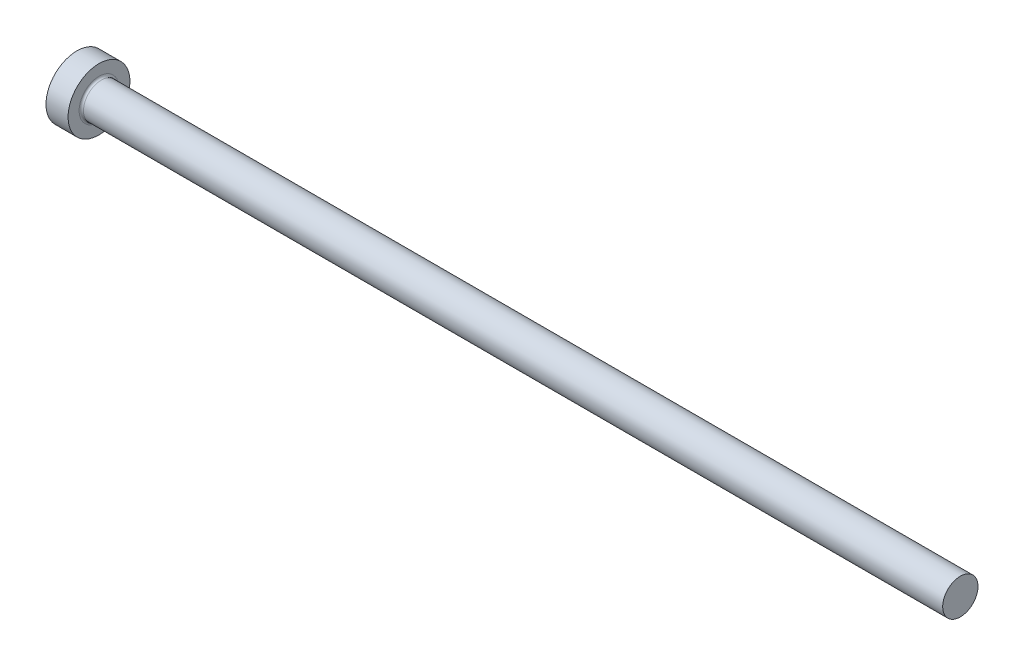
ISO-10303-21;
HEADER;
FILE_DESCRIPTION(('STEP AP214'),'2;1');
FILE_NAME('part.step','',(''),(''),'','','');
FILE_SCHEMA(('AUTOMOTIVE_DESIGN { 1 0 10303 214 1 1 1 1 }'));
ENDSEC;
DATA;
#1=APPLICATION_CONTEXT('core data for automotive mechanical design processes');
#2=APPLICATION_PROTOCOL_DEFINITION('international standard','automotive_design',2000,#1);
#3=PRODUCT_CONTEXT('',#1,'mechanical');
#4=PRODUCT('Part','Part','',(#3));
#5=PRODUCT_RELATED_PRODUCT_CATEGORY('part','',(#4));
#6=PRODUCT_DEFINITION_FORMATION('','',#4);
#7=PRODUCT_DEFINITION_CONTEXT('part definition',#1,'design');
#8=PRODUCT_DEFINITION('design','',#6,#7);
#9=PRODUCT_DEFINITION_SHAPE('','',#8);
#10=(LENGTH_UNIT() NAMED_UNIT(*) SI_UNIT(.MILLI.,.METRE.));
#11=(NAMED_UNIT(*) PLANE_ANGLE_UNIT() SI_UNIT($,.RADIAN.));
#12=(NAMED_UNIT(*) SI_UNIT($,.STERADIAN.) SOLID_ANGLE_UNIT());
#13=UNCERTAINTY_MEASURE_WITH_UNIT(LENGTH_MEASURE(1.E-05),#10,'distance_accuracy_value','');
#14=(GEOMETRIC_REPRESENTATION_CONTEXT(3) GLOBAL_UNCERTAINTY_ASSIGNED_CONTEXT((#13)) GLOBAL_UNIT_ASSIGNED_CONTEXT((#10,
#11,#12)) REPRESENTATION_CONTEXT('',''));
#15=CARTESIAN_POINT('',(0.,0.,0.));
#16=DIRECTION('',(0.,0.,1.));
#17=DIRECTION('',(1.,0.,0.));
#18=AXIS2_PLACEMENT_3D('',#15,#16,#17);
#19=CARTESIAN_POINT('',(0.,0.,0.));
#20=DIRECTION('',(-1.,0.,0.));
#21=DIRECTION('',(0.,-1.,0.));
#22=AXIS2_PLACEMENT_3D('',#19,#20,#21);
#23=PLANE('',#22);
#24=CARTESIAN_POINT('',(0.,0.,0.));
#25=DIRECTION('',(1.,0.,0.));
#26=DIRECTION('',(0.,1.,0.));
#27=AXIS2_PLACEMENT_3D('',#24,#25,#26);
#28=CIRCLE('',#27,7.);
#29=CARTESIAN_POINT('',(0.,7.,0.));
#30=VERTEX_POINT('',#29);
#31=EDGE_CURVE('E25',#30,#30,#28,.T.);
#32=ORIENTED_EDGE('',*,*,#31,.F.);
#33=EDGE_LOOP('',(#32));
#34=FACE_BOUND('',#33,.T.);
#35=ADVANCED_FACE('F14',(#34),#23,.T.);
#36=CARTESIAN_POINT('',(200.,0.,0.));
#37=DIRECTION('',(1.,0.,0.));
#38=DIRECTION('',(0.,1.,0.));
#39=AXIS2_PLACEMENT_3D('',#36,#37,#38);
#40=CYLINDRICAL_SURFACE('',#39,7.);
#41=ORIENTED_EDGE('',*,*,#31,.T.);
#42=EDGE_LOOP('',(#41));
#43=FACE_BOUND('',#42,.T.);
#44=CARTESIAN_POINT('',(5.,0.,0.));
#45=DIRECTION('',(1.,0.,0.));
#46=DIRECTION('',(0.,1.,0.));
#47=AXIS2_PLACEMENT_3D('',#44,#45,#46);
#48=CIRCLE('',#47,7.);
#49=CARTESIAN_POINT('',(5.,7.,0.));
#50=VERTEX_POINT('',#49);
#51=EDGE_CURVE('E29',#50,#50,#48,.T.);
#52=ORIENTED_EDGE('',*,*,#51,.F.);
#53=EDGE_LOOP('',(#52));
#54=FACE_BOUND('',#53,.T.);
#55=ADVANCED_FACE('F51',(#43,#54),#40,.T.);
#56=CARTESIAN_POINT('',(5.,7.,0.));
#57=DIRECTION('',(1.,0.,0.));
#58=DIRECTION('',(0.,1.,0.));
#59=AXIS2_PLACEMENT_3D('',#56,#57,#58);
#60=PLANE('',#59);
#61=CARTESIAN_POINT('',(5.,0.,0.));
#62=DIRECTION('',(1.,0.,0.));
#63=DIRECTION('',(0.,1.,0.));
#64=AXIS2_PLACEMENT_3D('',#61,#62,#63);
#65=CIRCLE('',#64,4.49999999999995);
#66=CARTESIAN_POINT('',(5.,4.49999999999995,0.));
#67=VERTEX_POINT('',#66);
#68=EDGE_CURVE('E9',#67,#67,#65,.F.);
#69=ORIENTED_EDGE('',*,*,#68,.T.);
#70=EDGE_LOOP('',(#69));
#71=FACE_BOUND('',#70,.T.);
#72=ORIENTED_EDGE('',*,*,#51,.T.);
#73=EDGE_LOOP('',(#72));
#74=FACE_BOUND('',#73,.T.);
#75=ADVANCED_FACE('F42',(#71,#74),#60,.T.);
#76=CARTESIAN_POINT('',(200.,0.,0.));
#77=DIRECTION('',(1.,0.,0.));
#78=DIRECTION('',(0.,1.,0.));
#79=AXIS2_PLACEMENT_3D('',#76,#77,#78);
#80=CYLINDRICAL_SURFACE('',#79,3.99999999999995);
#81=CARTESIAN_POINT('',(5.5,0.,0.));
#82=DIRECTION('',(1.,0.,0.));
#83=DIRECTION('',(0.,1.,0.));
#84=AXIS2_PLACEMENT_3D('',#81,#82,#83);
#85=CIRCLE('',#84,3.99999999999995);
#86=CARTESIAN_POINT('',(5.5,3.99999999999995,0.));
#87=VERTEX_POINT('',#86);
#88=EDGE_CURVE('E21',#87,#87,#85,.T.);
#89=ORIENTED_EDGE('',*,*,#88,.T.);
#90=EDGE_LOOP('',(#89));
#91=FACE_BOUND('',#90,.T.);
#92=CARTESIAN_POINT('',(200.,0.,0.));
#93=DIRECTION('',(1.,0.,0.));
#94=DIRECTION('',(0.,1.,0.));
#95=AXIS2_PLACEMENT_3D('',#92,#93,#94);
#96=CIRCLE('',#95,4.);
#97=CARTESIAN_POINT('',(200.,4.00000000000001,0.));
#98=VERTEX_POINT('',#97);
#99=EDGE_CURVE('E34',#98,#98,#96,.T.);
#100=ORIENTED_EDGE('',*,*,#99,.F.);
#101=EDGE_LOOP('',(#100));
#102=FACE_BOUND('',#101,.T.);
#103=ADVANCED_FACE('F40',(#91,#102),#80,.T.);
#104=CARTESIAN_POINT('',(200.,4.,0.));
#105=DIRECTION('',(1.,0.,0.));
#106=DIRECTION('',(0.,1.,0.));
#107=AXIS2_PLACEMENT_3D('',#104,#105,#106);
#108=PLANE('',#107);
#109=ORIENTED_EDGE('',*,*,#99,.T.);
#110=EDGE_LOOP('',(#109));
#111=FACE_BOUND('',#110,.T.);
#112=ADVANCED_FACE('F38',(#111),#108,.T.);
#113=CARTESIAN_POINT('',(5.5,0.,0.));
#114=DIRECTION('',(1.,0.,0.));
#115=DIRECTION('',(0.,1.,0.));
#116=AXIS2_PLACEMENT_3D('',#113,#114,#115);
#117=TOROIDAL_SURFACE('',#116,4.49999999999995,0.5);
#118=ORIENTED_EDGE('',*,*,#68,.F.);
#119=EDGE_LOOP('',(#118));
#120=FACE_BOUND('',#119,.T.);
#121=ORIENTED_EDGE('',*,*,#88,.F.);
#122=EDGE_LOOP('',(#121));
#123=FACE_BOUND('',#122,.T.);
#124=ADVANCED_FACE('F16',(#120,#123),#117,.F.);
#125=CLOSED_SHELL('',(#35,#55,#75,#103,#112,#124));
#126=MANIFOLD_SOLID_BREP('B1',#125);
#127=ADVANCED_BREP_SHAPE_REPRESENTATION('',(#18,#126),#14);
#128=SHAPE_DEFINITION_REPRESENTATION(#9,#127);
ENDSEC;
END-ISO-10303-21;
